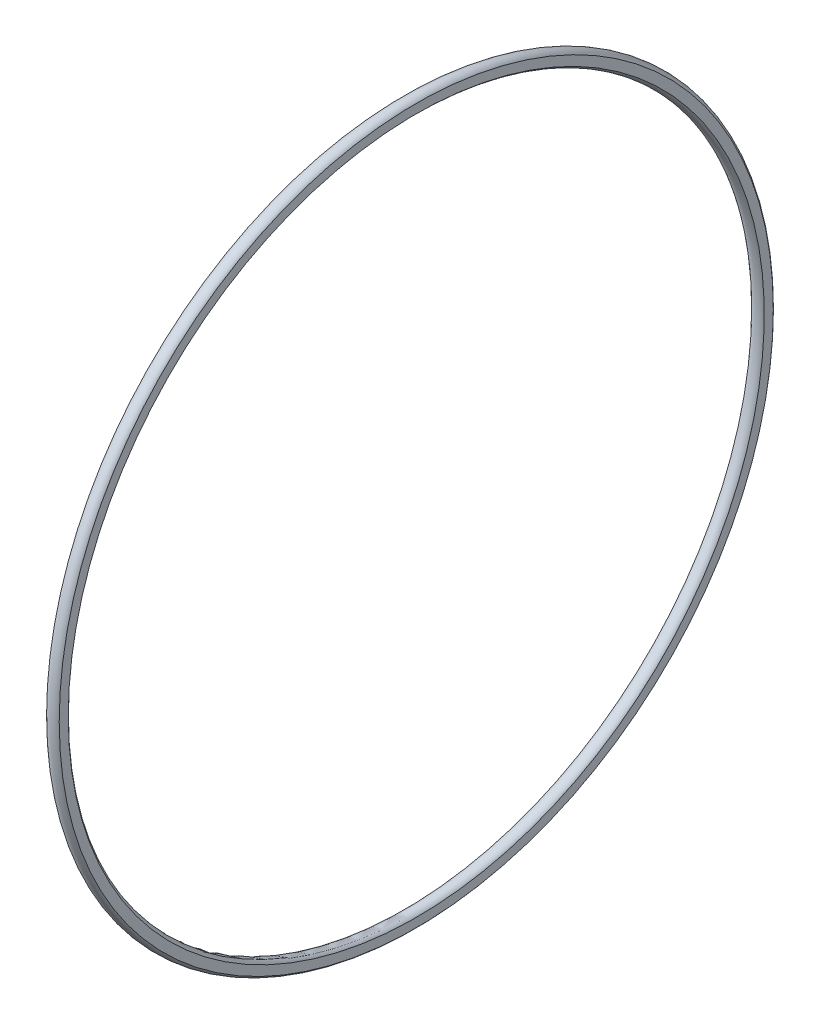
from build123d import *

# Parameters (mm, degrees)
ESQUISSE1_R             = 1.5
ESQUISSE2_W             = 172.442381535
ESQUISSE2_H             = 244.409420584
ENL_V_MAT_EXTRU_1_DEPTH = 10
ESQUISSE3_W             = 190.302046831
ESQUISSE3_H             = 161.875368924
ENL_V_MAT_EXTRU_2_DEPTH = 10


with BuildPart() as part:
    # Esquisse1 → R_volution1 (revolve)
    with BuildSketch(Plane.XY, mode=Mode.PRIVATE) as r_volution1_sk:
        with Locations((11.583516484, 68.5)):
            Circle(ESQUISSE1_R)
    revolve(r_volution1_sk.sketch.rotate(Axis((0, 0, 0), (1, 0, 0)), 90), axis=Axis((0, 0, 0), (1, 0, 0)))

    # Esquisse2 → Enl_v. mat.-Extru.1 (cut)
    with BuildSketch(Plane(origin=(10.5, 0, 0), x_dir=(0, 0, -1), z_dir=(1, 0, 0))):
        with Locations((-0.608304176, 0.06630891)):
            Rectangle(ESQUISSE2_W, ESQUISSE2_H)
    extrude(amount=-ENL_V_MAT_EXTRU_1_DEPTH, mode=Mode.SUBTRACT)

    # Esquisse3 → Enl_v. mat.-Extru.2 (cut)
    with BuildSketch(Plane(origin=(12.8, 0, 0), x_dir=(0, 0, -1), z_dir=(1, 0, 0))):
        with Locations((-6.586143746, -5.903510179)):
            Rectangle(ESQUISSE3_W, ESQUISSE3_H)
    extrude(amount=ENL_V_MAT_EXTRU_2_DEPTH, mode=Mode.SUBTRACT)


solid = part.part
